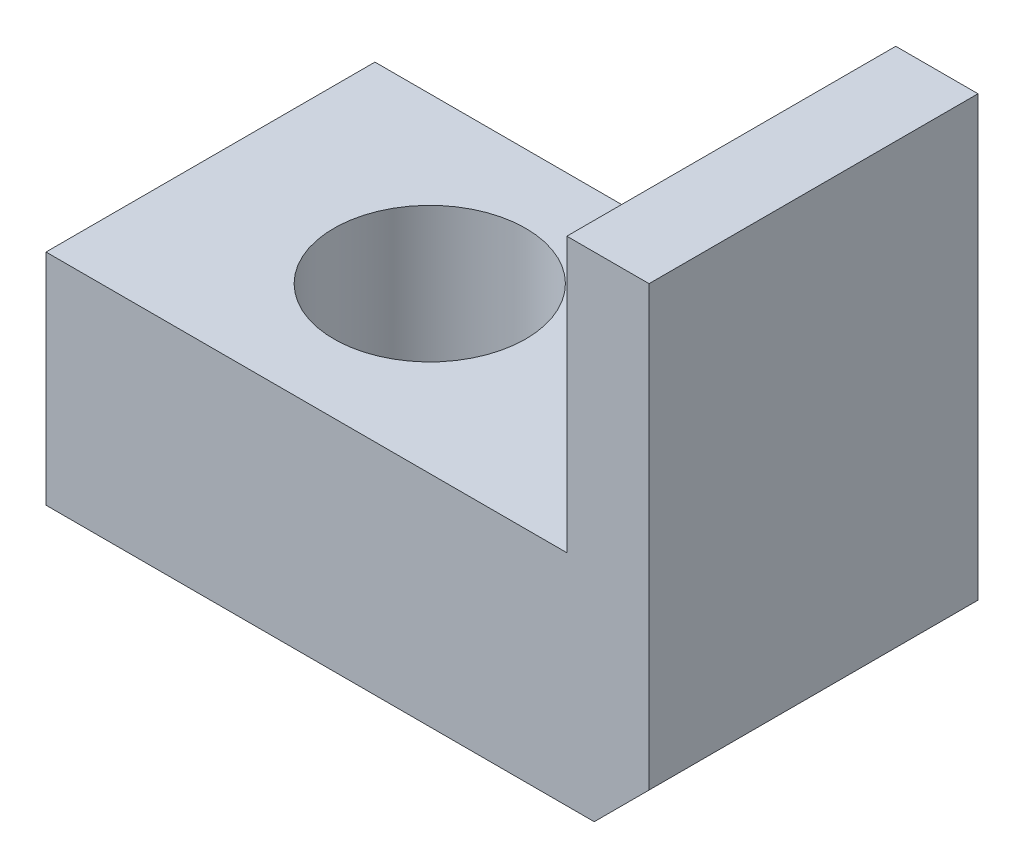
ISO-10303-21;
HEADER;
FILE_DESCRIPTION(('STEP AP214'),'2;1');
FILE_NAME('part.step','',(''),(''),'','','');
FILE_SCHEMA(('AUTOMOTIVE_DESIGN { 1 0 10303 214 1 1 1 1 }'));
ENDSEC;
DATA;
#1=APPLICATION_CONTEXT('core data for automotive mechanical design processes');
#2=APPLICATION_PROTOCOL_DEFINITION('international standard','automotive_design',2000,#1);
#3=PRODUCT_CONTEXT('',#1,'mechanical');
#4=PRODUCT('Part','Part','',(#3));
#5=PRODUCT_RELATED_PRODUCT_CATEGORY('part','',(#4));
#6=PRODUCT_DEFINITION_FORMATION('','',#4);
#7=PRODUCT_DEFINITION_CONTEXT('part definition',#1,'design');
#8=PRODUCT_DEFINITION('design','',#6,#7);
#9=PRODUCT_DEFINITION_SHAPE('','',#8);
#10=(LENGTH_UNIT() NAMED_UNIT(*) SI_UNIT(.MILLI.,.METRE.));
#11=(NAMED_UNIT(*) PLANE_ANGLE_UNIT() SI_UNIT($,.RADIAN.));
#12=(NAMED_UNIT(*) SI_UNIT($,.STERADIAN.) SOLID_ANGLE_UNIT());
#13=UNCERTAINTY_MEASURE_WITH_UNIT(LENGTH_MEASURE(1.E-05),#10,'distance_accuracy_value','');
#14=(GEOMETRIC_REPRESENTATION_CONTEXT(3) GLOBAL_UNCERTAINTY_ASSIGNED_CONTEXT((#13)) GLOBAL_UNIT_ASSIGNED_CONTEXT((#10,
#11,#12)) REPRESENTATION_CONTEXT('',''));
#15=CARTESIAN_POINT('',(0.,0.,0.));
#16=DIRECTION('',(0.,0.,1.));
#17=DIRECTION('',(1.,0.,0.));
#18=AXIS2_PLACEMENT_3D('',#15,#16,#17);
#19=CARTESIAN_POINT('',(111.739293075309,0.,6.));
#20=DIRECTION('',(-1.,0.,0.));
#21=DIRECTION('',(0.,0.,1.));
#22=AXIS2_PLACEMENT_3D('',#19,#20,#21);
#23=PLANE('',#22);
#24=DIRECTION('',(0.,1.,0.));
#25=VECTOR('',#24,1.);
#26=CARTESIAN_POINT('',(111.739293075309,0.,6.));
#27=LINE('',#26,#25);
#28=CARTESIAN_POINT('',(111.739293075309,-8.,6.));
#29=VERTEX_POINT('',#28);
#30=CARTESIAN_POINT('',(111.739293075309,0.,6.));
#31=VERTEX_POINT('',#30);
#32=EDGE_CURVE('E74',#29,#31,#27,.T.);
#33=ORIENTED_EDGE('',*,*,#32,.F.);
#34=DIRECTION('',(0.,0.,-1.));
#35=VECTOR('',#34,1.);
#36=CARTESIAN_POINT('',(111.739293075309,-8.,6.));
#37=LINE('',#36,#35);
#38=CARTESIAN_POINT('',(111.739293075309,-8.,0.));
#39=VERTEX_POINT('',#38);
#40=EDGE_CURVE('E97',#29,#39,#37,.T.);
#41=ORIENTED_EDGE('',*,*,#40,.T.);
#42=DIRECTION('',(0.,1.,0.));
#43=VECTOR('',#42,1.);
#44=CARTESIAN_POINT('',(111.739293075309,0.,0.));
#45=LINE('',#44,#43);
#46=CARTESIAN_POINT('',(111.739293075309,0.,0.));
#47=VERTEX_POINT('',#46);
#48=EDGE_CURVE('E95',#39,#47,#45,.T.);
#49=ORIENTED_EDGE('',*,*,#48,.T.);
#50=DIRECTION('',(0.,0.,-1.));
#51=VECTOR('',#50,1.);
#52=CARTESIAN_POINT('',(111.739293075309,0.,6.));
#53=LINE('',#52,#51);
#54=EDGE_CURVE('E89',#31,#47,#53,.T.);
#55=ORIENTED_EDGE('',*,*,#54,.F.);
#56=EDGE_LOOP('',(#33,#41,#49,#55));
#57=FACE_BOUND('',#56,.T.);
#58=ADVANCED_FACE('F16',(#57),#23,.F.);
#59=CARTESIAN_POINT('',(111.739293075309,0.,6.));
#60=DIRECTION('',(0.,-1.,0.));
#61=DIRECTION('',(1.,0.,0.));
#62=AXIS2_PLACEMENT_3D('',#59,#60,#61);
#63=PLANE('',#62);
#64=DIRECTION('',(-1.,0.,0.));
#65=VECTOR('',#64,1.);
#66=CARTESIAN_POINT('',(111.739293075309,0.,0.));
#67=LINE('',#66,#65);
#68=CARTESIAN_POINT('',(110.239293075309,0.,0.));
#69=VERTEX_POINT('',#68);
#70=EDGE_CURVE('E120',#47,#69,#67,.T.);
#71=ORIENTED_EDGE('',*,*,#70,.T.);
#72=DIRECTION('',(0.,0.,-1.));
#73=VECTOR('',#72,1.);
#74=CARTESIAN_POINT('',(110.239293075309,0.,6.));
#75=LINE('',#74,#73);
#76=CARTESIAN_POINT('',(110.239293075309,0.,6.));
#77=VERTEX_POINT('',#76);
#78=EDGE_CURVE('E91',#77,#69,#75,.T.);
#79=ORIENTED_EDGE('',*,*,#78,.F.);
#80=DIRECTION('',(-1.,0.,0.));
#81=VECTOR('',#80,1.);
#82=CARTESIAN_POINT('',(111.739293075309,0.,6.));
#83=LINE('',#82,#81);
#84=EDGE_CURVE('E77',#31,#77,#83,.T.);
#85=ORIENTED_EDGE('',*,*,#84,.F.);
#86=ORIENTED_EDGE('',*,*,#54,.T.);
#87=EDGE_LOOP('',(#71,#79,#85,#86));
#88=FACE_BOUND('',#87,.T.);
#89=ADVANCED_FACE('F88',(#88),#63,.F.);
#90=CARTESIAN_POINT('',(110.239293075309,0.,6.));
#91=DIRECTION('',(1.,0.,0.));
#92=DIRECTION('',(0.,0.,-1.));
#93=AXIS2_PLACEMENT_3D('',#90,#91,#92);
#94=PLANE('',#93);
#95=DIRECTION('',(0.,-1.,0.));
#96=VECTOR('',#95,1.);
#97=CARTESIAN_POINT('',(110.239293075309,0.,0.));
#98=LINE('',#97,#96);
#99=CARTESIAN_POINT('',(110.239293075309,-5.,0.));
#100=VERTEX_POINT('',#99);
#101=EDGE_CURVE('E118',#69,#100,#98,.T.);
#102=ORIENTED_EDGE('',*,*,#101,.T.);
#103=DIRECTION('',(0.,0.,-1.));
#104=VECTOR('',#103,1.);
#105=CARTESIAN_POINT('',(110.239293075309,-5.,6.));
#106=LINE('',#105,#104);
#107=CARTESIAN_POINT('',(110.239293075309,-5.,6.));
#108=VERTEX_POINT('',#107);
#109=EDGE_CURVE('E100',#108,#100,#106,.T.);
#110=ORIENTED_EDGE('',*,*,#109,.F.);
#111=DIRECTION('',(0.,-1.,0.));
#112=VECTOR('',#111,1.);
#113=CARTESIAN_POINT('',(110.239293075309,0.,6.));
#114=LINE('',#113,#112);
#115=EDGE_CURVE('E93',#77,#108,#114,.T.);
#116=ORIENTED_EDGE('',*,*,#115,.F.);
#117=ORIENTED_EDGE('',*,*,#78,.T.);
#118=EDGE_LOOP('',(#102,#110,#116,#117));
#119=FACE_BOUND('',#118,.T.);
#120=ADVANCED_FACE('F150',(#119),#94,.F.);
#121=CARTESIAN_POINT('',(110.239293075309,-5.,6.));
#122=DIRECTION('',(0.,-1.,0.));
#123=DIRECTION('',(1.,0.,0.));
#124=AXIS2_PLACEMENT_3D('',#121,#122,#123);
#125=PLANE('',#124);
#126=CARTESIAN_POINT('',(104.739293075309,-5.,3.));
#127=DIRECTION('',(0.,-1.,0.));
#128=DIRECTION('',(1.,0.,0.));
#129=AXIS2_PLACEMENT_3D('',#126,#127,#128);
#130=CIRCLE('',#129,1.75);
#131=CARTESIAN_POINT('',(106.489293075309,-5.,3.));
#132=VERTEX_POINT('',#131);
#133=EDGE_CURVE('E123',#132,#132,#130,.T.);
#134=ORIENTED_EDGE('',*,*,#133,.T.);
#135=EDGE_LOOP('',(#134));
#136=FACE_BOUND('',#135,.T.);
#137=DIRECTION('',(-1.,0.,0.));
#138=VECTOR('',#137,1.);
#139=CARTESIAN_POINT('',(110.239293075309,-5.,0.));
#140=LINE('',#139,#138);
#141=CARTESIAN_POINT('',(100.739293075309,-5.,0.));
#142=VERTEX_POINT('',#141);
#143=EDGE_CURVE('E116',#100,#142,#140,.T.);
#144=ORIENTED_EDGE('',*,*,#143,.T.);
#145=DIRECTION('',(0.,0.,-1.));
#146=VECTOR('',#145,1.);
#147=CARTESIAN_POINT('',(100.739293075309,-5.,6.));
#148=LINE('',#147,#146);
#149=CARTESIAN_POINT('',(100.739293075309,-5.,6.));
#150=VERTEX_POINT('',#149);
#151=EDGE_CURVE('E106',#150,#142,#148,.T.);
#152=ORIENTED_EDGE('',*,*,#151,.F.);
#153=DIRECTION('',(-1.,0.,0.));
#154=VECTOR('',#153,1.);
#155=CARTESIAN_POINT('',(110.239293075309,-5.,6.));
#156=LINE('',#155,#154);
#157=EDGE_CURVE('E127',#108,#150,#156,.T.);
#158=ORIENTED_EDGE('',*,*,#157,.F.);
#159=ORIENTED_EDGE('',*,*,#109,.T.);
#160=EDGE_LOOP('',(#144,#152,#158,#159));
#161=FACE_BOUND('',#160,.T.);
#162=ADVANCED_FACE('F156',(#136,#161),#125,.F.);
#163=CARTESIAN_POINT('',(100.739293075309,-9.,6.));
#164=DIRECTION('',(1.,0.,0.));
#165=DIRECTION('',(0.,0.,-1.));
#166=AXIS2_PLACEMENT_3D('',#163,#164,#165);
#167=PLANE('',#166);
#168=DIRECTION('',(0.,-1.,0.));
#169=VECTOR('',#168,1.);
#170=CARTESIAN_POINT('',(100.739293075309,-9.,0.));
#171=LINE('',#170,#169);
#172=CARTESIAN_POINT('',(100.739293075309,-9.,0.));
#173=VERTEX_POINT('',#172);
#174=EDGE_CURVE('E114',#142,#173,#171,.T.);
#175=ORIENTED_EDGE('',*,*,#174,.T.);
#176=DIRECTION('',(0.,0.,-1.));
#177=VECTOR('',#176,1.);
#178=CARTESIAN_POINT('',(100.739293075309,-9.,6.));
#179=LINE('',#178,#177);
#180=CARTESIAN_POINT('',(100.739293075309,-9.,6.));
#181=VERTEX_POINT('',#180);
#182=EDGE_CURVE('E109',#181,#173,#179,.T.);
#183=ORIENTED_EDGE('',*,*,#182,.F.);
#184=DIRECTION('',(0.,-1.,0.));
#185=VECTOR('',#184,1.);
#186=CARTESIAN_POINT('',(100.739293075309,-9.,6.));
#187=LINE('',#186,#185);
#188=EDGE_CURVE('E125',#150,#181,#187,.T.);
#189=ORIENTED_EDGE('',*,*,#188,.F.);
#190=ORIENTED_EDGE('',*,*,#151,.T.);
#191=EDGE_LOOP('',(#175,#183,#189,#190));
#192=FACE_BOUND('',#191,.T.);
#193=ADVANCED_FACE('F141',(#192),#167,.F.);
#194=CARTESIAN_POINT('',(111.739293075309,-9.,6.));
#195=DIRECTION('',(0.,1.,0.));
#196=DIRECTION('',(-1.,0.,0.));
#197=AXIS2_PLACEMENT_3D('',#194,#195,#196);
#198=PLANE('',#197);
#199=CARTESIAN_POINT('',(104.739293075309,-9.,3.));
#200=DIRECTION('',(0.,-1.,0.));
#201=DIRECTION('',(0.,0.,-1.));
#202=AXIS2_PLACEMENT_3D('',#199,#200,#201);
#203=CIRCLE('',#202,1.75);
#204=CARTESIAN_POINT('',(104.739293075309,-9.,1.25));
#205=VERTEX_POINT('',#204);
#206=EDGE_CURVE('E132',#205,#205,#203,.T.);
#207=ORIENTED_EDGE('',*,*,#206,.F.);
#208=EDGE_LOOP('',(#207));
#209=FACE_BOUND('',#208,.T.);
#210=DIRECTION('',(1.,0.,0.));
#211=VECTOR('',#210,1.);
#212=CARTESIAN_POINT('',(111.739293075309,-9.,0.));
#213=LINE('',#212,#211);
#214=CARTESIAN_POINT('',(110.739293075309,-9.,0.));
#215=VERTEX_POINT('',#214);
#216=EDGE_CURVE('E84',#173,#215,#213,.T.);
#217=ORIENTED_EDGE('',*,*,#216,.T.);
#218=DIRECTION('',(0.,0.,1.));
#219=VECTOR('',#218,1.);
#220=CARTESIAN_POINT('',(110.739293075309,-9.,6.));
#221=LINE('',#220,#219);
#222=CARTESIAN_POINT('',(110.739293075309,-9.,6.));
#223=VERTEX_POINT('',#222);
#224=EDGE_CURVE('E24',#215,#223,#221,.T.);
#225=ORIENTED_EDGE('',*,*,#224,.T.);
#226=DIRECTION('',(1.,0.,0.));
#227=VECTOR('',#226,1.);
#228=CARTESIAN_POINT('',(111.739293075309,-9.,6.));
#229=LINE('',#228,#227);
#230=EDGE_CURVE('E112',#181,#223,#229,.T.);
#231=ORIENTED_EDGE('',*,*,#230,.F.);
#232=ORIENTED_EDGE('',*,*,#182,.T.);
#233=EDGE_LOOP('',(#217,#225,#231,#232));
#234=FACE_BOUND('',#233,.T.);
#235=ADVANCED_FACE('F139',(#209,#234),#198,.F.);
#236=CARTESIAN_POINT('',(0.,0.,6.));
#237=DIRECTION('',(0.,0.,-1.));
#238=DIRECTION('',(-1.,0.,0.));
#239=AXIS2_PLACEMENT_3D('',#236,#237,#238);
#240=PLANE('',#239);
#241=ORIENTED_EDGE('',*,*,#230,.T.);
#242=DIRECTION('',(-0.707106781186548,-0.707106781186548,0.));
#243=VECTOR('',#242,1.);
#244=CARTESIAN_POINT('',(111.739293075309,-8.,6.));
#245=LINE('',#244,#243);
#246=EDGE_CURVE('E11',#223,#29,#245,.F.);
#247=ORIENTED_EDGE('',*,*,#246,.T.);
#248=ORIENTED_EDGE('',*,*,#32,.T.);
#249=ORIENTED_EDGE('',*,*,#84,.T.);
#250=ORIENTED_EDGE('',*,*,#115,.T.);
#251=ORIENTED_EDGE('',*,*,#157,.T.);
#252=ORIENTED_EDGE('',*,*,#188,.T.);
#253=EDGE_LOOP('',(#241,#247,#248,#249,#250,#251,#252));
#254=FACE_BOUND('',#253,.T.);
#255=ADVANCED_FACE('F76',(#254),#240,.F.);
#256=CARTESIAN_POINT('',(0.,0.,0.));
#257=DIRECTION('',(0.,0.,-1.));
#258=DIRECTION('',(-1.,0.,0.));
#259=AXIS2_PLACEMENT_3D('',#256,#257,#258);
#260=PLANE('',#259);
#261=ORIENTED_EDGE('',*,*,#48,.F.);
#262=DIRECTION('',(0.707106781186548,0.707106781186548,0.));
#263=VECTOR('',#262,1.);
#264=CARTESIAN_POINT('',(59.8696465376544,-59.8696465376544,0.));
#265=LINE('',#264,#263);
#266=EDGE_CURVE('E38',#39,#215,#265,.F.);
#267=ORIENTED_EDGE('',*,*,#266,.T.);
#268=ORIENTED_EDGE('',*,*,#216,.F.);
#269=ORIENTED_EDGE('',*,*,#174,.F.);
#270=ORIENTED_EDGE('',*,*,#143,.F.);
#271=ORIENTED_EDGE('',*,*,#101,.F.);
#272=ORIENTED_EDGE('',*,*,#70,.F.);
#273=EDGE_LOOP('',(#261,#267,#268,#269,#270,#271,#272));
#274=FACE_BOUND('',#273,.T.);
#275=ADVANCED_FACE('F146',(#274),#260,.T.);
#276=CARTESIAN_POINT('',(104.739293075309,-9.,3.));
#277=DIRECTION('',(0.,-1.,0.));
#278=DIRECTION('',(0.,0.,-1.));
#279=AXIS2_PLACEMENT_3D('',#276,#277,#278);
#280=CYLINDRICAL_SURFACE('',#279,1.75);
#281=ORIENTED_EDGE('',*,*,#206,.T.);
#282=EDGE_LOOP('',(#281));
#283=FACE_BOUND('',#282,.T.);
#284=ORIENTED_EDGE('',*,*,#133,.F.);
#285=EDGE_LOOP('',(#284));
#286=FACE_BOUND('',#285,.T.);
#287=ADVANCED_FACE('F136',(#283,#286),#280,.F.);
#288=CARTESIAN_POINT('',(111.739293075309,-8.,6.));
#289=DIRECTION('',(-0.707106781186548,0.707106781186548,0.));
#290=DIRECTION('',(0.,0.,-1.));
#291=AXIS2_PLACEMENT_3D('',#288,#289,#290);
#292=PLANE('',#291);
#293=ORIENTED_EDGE('',*,*,#246,.F.);
#294=ORIENTED_EDGE('',*,*,#224,.F.);
#295=ORIENTED_EDGE('',*,*,#266,.F.);
#296=ORIENTED_EDGE('',*,*,#40,.F.);
#297=EDGE_LOOP('',(#293,#294,#295,#296));
#298=FACE_BOUND('',#297,.T.);
#299=ADVANCED_FACE('F18',(#298),#292,.F.);
#300=CLOSED_SHELL('',(#58,#89,#120,#162,#193,#235,#255,#275,#287,#299));
#301=MANIFOLD_SOLID_BREP('B1',#300);
#302=ADVANCED_BREP_SHAPE_REPRESENTATION('',(#18,#301),#14);
#303=SHAPE_DEFINITION_REPRESENTATION(#9,#302);
ENDSEC;
END-ISO-10303-21;
